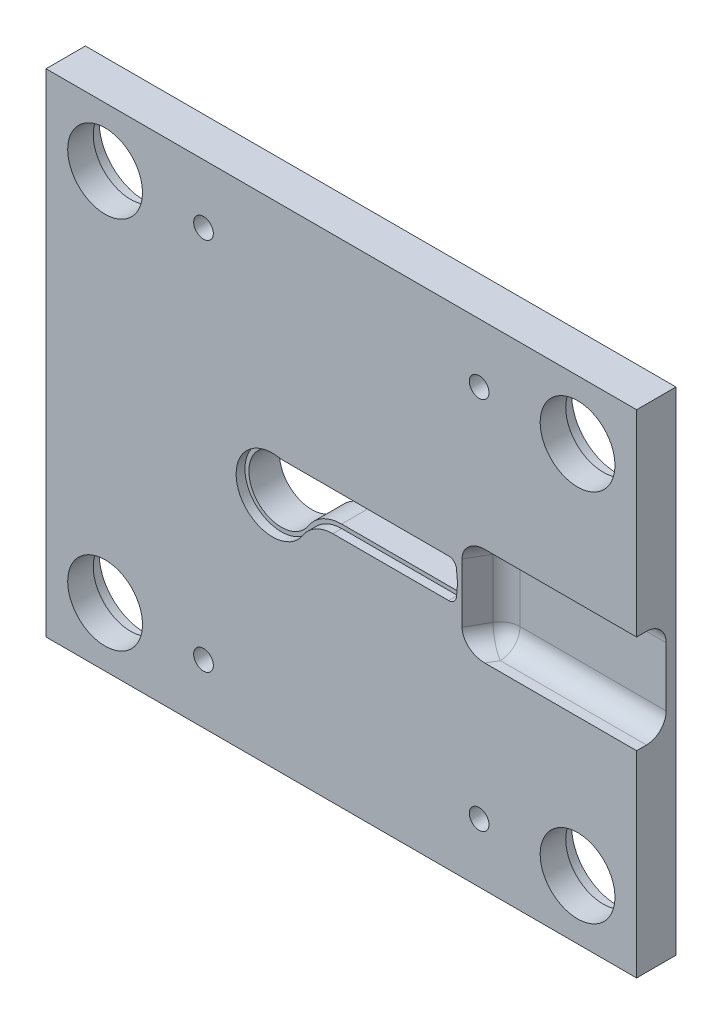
ISO-10303-21;
HEADER;
FILE_DESCRIPTION(('STEP AP214'),'2;1');
FILE_NAME('part.step','',(''),(''),'','','');
FILE_SCHEMA(('AUTOMOTIVE_DESIGN { 1 0 10303 214 1 1 1 1 }'));
ENDSEC;
DATA;
#1=APPLICATION_CONTEXT('core data for automotive mechanical design processes');
#2=APPLICATION_PROTOCOL_DEFINITION('international standard','automotive_design',2000,#1);
#3=PRODUCT_CONTEXT('',#1,'mechanical');
#4=PRODUCT('Part','Part','',(#3));
#5=PRODUCT_RELATED_PRODUCT_CATEGORY('part','',(#4));
#6=PRODUCT_DEFINITION_FORMATION('','',#4);
#7=PRODUCT_DEFINITION_CONTEXT('part definition',#1,'design');
#8=PRODUCT_DEFINITION('design','',#6,#7);
#9=PRODUCT_DEFINITION_SHAPE('','',#8);
#10=(LENGTH_UNIT() NAMED_UNIT(*) SI_UNIT(.MILLI.,.METRE.));
#11=(NAMED_UNIT(*) PLANE_ANGLE_UNIT() SI_UNIT($,.RADIAN.));
#12=(NAMED_UNIT(*) SI_UNIT($,.STERADIAN.) SOLID_ANGLE_UNIT());
#13=UNCERTAINTY_MEASURE_WITH_UNIT(LENGTH_MEASURE(1.E-05),#10,'distance_accuracy_value','');
#14=(GEOMETRIC_REPRESENTATION_CONTEXT(3) GLOBAL_UNCERTAINTY_ASSIGNED_CONTEXT((#13)) GLOBAL_UNIT_ASSIGNED_CONTEXT((#10,
#11,#12)) REPRESENTATION_CONTEXT('',''));
#15=CARTESIAN_POINT('',(0.,0.,0.));
#16=DIRECTION('',(0.,0.,1.));
#17=DIRECTION('',(1.,0.,0.));
#18=AXIS2_PLACEMENT_3D('',#15,#16,#17);
#19=CARTESIAN_POINT('',(121.078190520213,155.965,0.));
#20=DIRECTION('',(0.,0.,1.));
#21=DIRECTION('',(1.,0.,0.));
#22=AXIS2_PLACEMENT_3D('',#19,#20,#21);
#23=CYLINDRICAL_SURFACE('',#22,20.03);
#24=CARTESIAN_POINT('',(121.078190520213,155.965,15.5));
#25=DIRECTION('',(0.,0.,1.));
#26=DIRECTION('',(1.,0.,0.));
#27=AXIS2_PLACEMENT_3D('',#24,#25,#26);
#28=CIRCLE('',#27,20.03);
#29=CARTESIAN_POINT('',(117.740393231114,136.215063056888,15.5));
#30=VERTEX_POINT('',#29);
#31=CARTESIAN_POINT('',(121.078190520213,135.935,15.5));
#32=VERTEX_POINT('',#31);
#33=EDGE_CURVE('E420',#30,#32,#28,.T.);
#34=ORIENTED_EDGE('',*,*,#33,.F.);
#35=DIRECTION('',(0.,0.,1.));
#36=VECTOR('',#35,1.);
#37=CARTESIAN_POINT('',(117.740393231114,136.215063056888,0.));
#38=LINE('',#37,#36);
#39=CARTESIAN_POINT('',(117.740393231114,136.215063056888,0.));
#40=VERTEX_POINT('',#39);
#41=EDGE_CURVE('E449',#40,#30,#38,.T.);
#42=ORIENTED_EDGE('',*,*,#41,.F.);
#43=CARTESIAN_POINT('',(121.078190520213,155.965,0.));
#44=DIRECTION('',(0.,0.,-1.));
#45=DIRECTION('',(-1.,0.,0.));
#46=AXIS2_PLACEMENT_3D('',#43,#44,#45);
#47=CIRCLE('',#46,20.03);
#48=CARTESIAN_POINT('',(121.078190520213,135.935,0.));
#49=VERTEX_POINT('',#48);
#50=EDGE_CURVE('E422',#49,#40,#47,.T.);
#51=ORIENTED_EDGE('',*,*,#50,.F.);
#52=DIRECTION('',(0.,0.,1.));
#53=VECTOR('',#52,1.);
#54=CARTESIAN_POINT('',(121.078190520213,135.935,0.));
#55=LINE('',#54,#53);
#56=EDGE_CURVE('E261',#49,#32,#55,.T.);
#57=ORIENTED_EDGE('',*,*,#56,.T.);
#58=EDGE_LOOP('',(#34,#42,#51,#57));
#59=FACE_BOUND('',#58,.T.);
#60=ADVANCED_FACE('F31',(#59),#23,.T.);
#61=CARTESIAN_POINT('',(121.078190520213,135.935,0.));
#62=DIRECTION('',(0.,1.,0.));
#63=DIRECTION('',(-1.,0.,0.));
#64=AXIS2_PLACEMENT_3D('',#61,#62,#63);
#65=PLANE('',#64);
#66=DIRECTION('',(1.,0.,0.));
#67=VECTOR('',#66,1.);
#68=CARTESIAN_POINT('',(121.078190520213,135.935,15.5));
#69=LINE('',#68,#67);
#70=CARTESIAN_POINT('',(204.489847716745,135.935,15.5));
#71=VERTEX_POINT('',#70);
#72=EDGE_CURVE('E418',#32,#71,#69,.T.);
#73=ORIENTED_EDGE('',*,*,#72,.F.);
#74=ORIENTED_EDGE('',*,*,#56,.F.);
#75=DIRECTION('',(-1.,0.,0.));
#76=VECTOR('',#75,1.);
#77=CARTESIAN_POINT('',(121.078190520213,135.935,0.));
#78=LINE('',#77,#76);
#79=CARTESIAN_POINT('',(204.489847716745,135.935,0.));
#80=VERTEX_POINT('',#79);
#81=EDGE_CURVE('E446',#80,#49,#78,.T.);
#82=ORIENTED_EDGE('',*,*,#81,.F.);
#83=DIRECTION('',(0.,0.,1.));
#84=VECTOR('',#83,1.);
#85=CARTESIAN_POINT('',(204.489847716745,135.935,0.));
#86=LINE('',#85,#84);
#87=EDGE_CURVE('E452',#80,#71,#86,.T.);
#88=ORIENTED_EDGE('',*,*,#87,.T.);
#89=EDGE_LOOP('',(#73,#74,#82,#88));
#90=FACE_BOUND('',#89,.T.);
#91=ADVANCED_FACE('F527',(#90),#65,.F.);
#92=CARTESIAN_POINT('',(204.489847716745,133.905,0.));
#93=DIRECTION('',(0.,0.,1.));
#94=DIRECTION('',(1.,0.,0.));
#95=AXIS2_PLACEMENT_3D('',#92,#93,#94);
#96=CYLINDRICAL_SURFACE('',#95,2.02999999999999);
#97=CARTESIAN_POINT('',(204.489847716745,133.905,15.5));
#98=DIRECTION('',(0.,0.,1.));
#99=DIRECTION('',(1.,0.,0.));
#100=AXIS2_PLACEMENT_3D('',#97,#98,#99);
#101=CIRCLE('',#100,2.02999999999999);
#102=CARTESIAN_POINT('',(206.512122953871,134.081926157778,15.5));
#103=VERTEX_POINT('',#102);
#104=EDGE_CURVE('E416',#71,#103,#101,.F.);
#105=ORIENTED_EDGE('',*,*,#104,.F.);
#106=ORIENTED_EDGE('',*,*,#87,.F.);
#107=CARTESIAN_POINT('',(204.489847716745,133.905,0.));
#108=DIRECTION('',(0.,0.,1.));
#109=DIRECTION('',(-1.,0.,0.));
#110=AXIS2_PLACEMENT_3D('',#107,#108,#109);
#111=CIRCLE('',#110,2.02999999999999);
#112=CARTESIAN_POINT('',(206.512122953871,134.081926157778,0.));
#113=VERTEX_POINT('',#112);
#114=EDGE_CURVE('E443',#113,#80,#111,.T.);
#115=ORIENTED_EDGE('',*,*,#114,.F.);
#116=DIRECTION('',(0.,0.,1.));
#117=VECTOR('',#116,1.);
#118=CARTESIAN_POINT('',(206.512122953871,134.081926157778,0.));
#119=LINE('',#118,#117);
#120=EDGE_CURVE('E455',#113,#103,#119,.T.);
#121=ORIENTED_EDGE('',*,*,#120,.T.);
#122=EDGE_LOOP('',(#105,#106,#115,#121));
#123=FACE_BOUND('',#122,.T.);
#124=ADVANCED_FACE('F533',(#123),#96,.F.);
#125=CARTESIAN_POINT('',(206.512122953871,134.081926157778,0.));
#126=DIRECTION('',(0.996194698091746,0.0871557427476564,0.));
#127=DIRECTION('',(-0.0871557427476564,0.996194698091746,0.));
#128=AXIS2_PLACEMENT_3D('',#125,#126,#127);
#129=PLANE('',#128);
#130=DIRECTION('',(0.0871557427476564,-0.996194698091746,0.));
#131=VECTOR('',#130,1.);
#132=CARTESIAN_POINT('',(206.512122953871,134.081926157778,15.5));
#133=LINE('',#132,#131);
#134=CARTESIAN_POINT('',(207.033723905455,128.12,15.5));
#135=VERTEX_POINT('',#134);
#136=EDGE_CURVE('E414',#103,#135,#133,.T.);
#137=ORIENTED_EDGE('',*,*,#136,.F.);
#138=ORIENTED_EDGE('',*,*,#120,.F.);
#139=DIRECTION('',(-0.0871557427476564,0.996194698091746,0.));
#140=VECTOR('',#139,1.);
#141=CARTESIAN_POINT('',(206.512122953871,134.081926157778,0.));
#142=LINE('',#141,#140);
#143=CARTESIAN_POINT('',(207.033723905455,128.12,0.));
#144=VERTEX_POINT('',#143);
#145=EDGE_CURVE('E440',#144,#113,#142,.T.);
#146=ORIENTED_EDGE('',*,*,#145,.F.);
#147=DIRECTION('',(0.,0.,1.));
#148=VECTOR('',#147,1.);
#149=CARTESIAN_POINT('',(207.033723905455,128.12,0.));
#150=LINE('',#149,#148);
#151=EDGE_CURVE('E458',#144,#135,#150,.T.);
#152=ORIENTED_EDGE('',*,*,#151,.T.);
#153=EDGE_LOOP('',(#137,#138,#146,#152));
#154=FACE_BOUND('',#153,.T.);
#155=ADVANCED_FACE('F754',(#154),#129,.F.);
#156=CARTESIAN_POINT('',(206.512122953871,122.158073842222,0.));
#157=DIRECTION('',(0.996194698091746,-0.0871557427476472,0.));
#158=DIRECTION('',(0.0871557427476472,0.996194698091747,0.));
#159=AXIS2_PLACEMENT_3D('',#156,#157,#158);
#160=PLANE('',#159);
#161=DIRECTION('',(-0.0871557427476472,-0.996194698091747,0.));
#162=VECTOR('',#161,1.);
#163=CARTESIAN_POINT('',(206.512122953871,122.158073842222,15.5));
#164=LINE('',#163,#162);
#165=CARTESIAN_POINT('',(206.512122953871,122.158073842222,15.5));
#166=VERTEX_POINT('',#165);
#167=EDGE_CURVE('E412',#135,#166,#164,.T.);
#168=ORIENTED_EDGE('',*,*,#167,.F.);
#169=ORIENTED_EDGE('',*,*,#151,.F.);
#170=DIRECTION('',(0.0871557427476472,0.996194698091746,0.));
#171=VECTOR('',#170,1.);
#172=CARTESIAN_POINT('',(206.512122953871,122.158073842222,0.));
#173=LINE('',#172,#171);
#174=CARTESIAN_POINT('',(206.512122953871,122.158073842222,0.));
#175=VERTEX_POINT('',#174);
#176=EDGE_CURVE('E437',#175,#144,#173,.T.);
#177=ORIENTED_EDGE('',*,*,#176,.F.);
#178=DIRECTION('',(0.,0.,1.));
#179=VECTOR('',#178,1.);
#180=CARTESIAN_POINT('',(206.512122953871,122.158073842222,0.));
#181=LINE('',#180,#179);
#182=EDGE_CURVE('E461',#175,#166,#181,.T.);
#183=ORIENTED_EDGE('',*,*,#182,.T.);
#184=EDGE_LOOP('',(#168,#169,#177,#183));
#185=FACE_BOUND('',#184,.T.);
#186=ADVANCED_FACE('F744',(#185),#160,.F.);
#187=CARTESIAN_POINT('',(204.489847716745,122.335,0.));
#188=DIRECTION('',(0.,0.,1.));
#189=DIRECTION('',(1.,0.,0.));
#190=AXIS2_PLACEMENT_3D('',#187,#188,#189);
#191=CYLINDRICAL_SURFACE('',#190,2.03000000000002);
#192=CARTESIAN_POINT('',(204.489847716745,122.335,15.5));
#193=DIRECTION('',(0.,0.,1.));
#194=DIRECTION('',(1.,0.,0.));
#195=AXIS2_PLACEMENT_3D('',#192,#193,#194);
#196=CIRCLE('',#195,2.03000000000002);
#197=CARTESIAN_POINT('',(204.489847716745,120.305,15.5));
#198=VERTEX_POINT('',#197);
#199=EDGE_CURVE('E410',#166,#198,#196,.F.);
#200=ORIENTED_EDGE('',*,*,#199,.F.);
#201=ORIENTED_EDGE('',*,*,#182,.F.);
#202=CARTESIAN_POINT('',(204.489847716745,122.335,0.));
#203=DIRECTION('',(0.,0.,1.));
#204=DIRECTION('',(1.,0.,0.));
#205=AXIS2_PLACEMENT_3D('',#202,#203,#204);
#206=CIRCLE('',#205,2.03000000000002);
#207=CARTESIAN_POINT('',(204.489847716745,120.305,0.));
#208=VERTEX_POINT('',#207);
#209=EDGE_CURVE('E434',#208,#175,#206,.T.);
#210=ORIENTED_EDGE('',*,*,#209,.F.);
#211=DIRECTION('',(0.,0.,1.));
#212=VECTOR('',#211,1.);
#213=CARTESIAN_POINT('',(204.489847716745,120.305,0.));
#214=LINE('',#213,#212);
#215=EDGE_CURVE('E464',#208,#198,#214,.T.);
#216=ORIENTED_EDGE('',*,*,#215,.T.);
#217=EDGE_LOOP('',(#200,#201,#210,#216));
#218=FACE_BOUND('',#217,.T.);
#219=ADVANCED_FACE('F734',(#218),#191,.F.);
#220=CARTESIAN_POINT('',(145.681427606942,120.305,0.));
#221=DIRECTION('',(0.,-1.,0.));
#222=DIRECTION('',(1.,0.,0.));
#223=AXIS2_PLACEMENT_3D('',#220,#221,#222);
#224=PLANE('',#223);
#225=DIRECTION('',(-1.,0.,0.));
#226=VECTOR('',#225,1.);
#227=CARTESIAN_POINT('',(145.681427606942,120.305,15.5));
#228=LINE('',#227,#226);
#229=CARTESIAN_POINT('',(145.681427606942,120.305,15.5));
#230=VERTEX_POINT('',#229);
#231=EDGE_CURVE('E408',#198,#230,#228,.T.);
#232=ORIENTED_EDGE('',*,*,#231,.F.);
#233=ORIENTED_EDGE('',*,*,#215,.F.);
#234=DIRECTION('',(1.,0.,0.));
#235=VECTOR('',#234,1.);
#236=CARTESIAN_POINT('',(145.681427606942,120.305,0.));
#237=LINE('',#236,#235);
#238=CARTESIAN_POINT('',(145.681427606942,120.305,0.));
#239=VERTEX_POINT('',#238);
#240=EDGE_CURVE('E431',#239,#208,#237,.T.);
#241=ORIENTED_EDGE('',*,*,#240,.F.);
#242=DIRECTION('',(0.,0.,1.));
#243=VECTOR('',#242,1.);
#244=CARTESIAN_POINT('',(145.681427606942,120.305,0.));
#245=LINE('',#244,#243);
#246=EDGE_CURVE('E467',#239,#230,#245,.T.);
#247=ORIENTED_EDGE('',*,*,#246,.T.);
#248=EDGE_LOOP('',(#232,#233,#241,#247));
#249=FACE_BOUND('',#248,.T.);
#250=ADVANCED_FACE('F725',(#249),#224,.F.);
#251=CARTESIAN_POINT('',(145.681427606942,100.275,0.));
#252=DIRECTION('',(0.,0.,1.));
#253=DIRECTION('',(1.,0.,0.));
#254=AXIS2_PLACEMENT_3D('',#251,#252,#253);
#255=CYLINDRICAL_SURFACE('',#254,20.03);
#256=CARTESIAN_POINT('',(145.681427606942,100.275,15.5));
#257=DIRECTION('',(0.,0.,1.));
#258=DIRECTION('',(1.,0.,0.));
#259=AXIS2_PLACEMENT_3D('',#256,#257,#258);
#260=CIRCLE('',#259,20.03);
#261=CARTESIAN_POINT('',(128.832928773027,111.106850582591,15.5));
#262=VERTEX_POINT('',#261);
#263=EDGE_CURVE('E390',#230,#262,#260,.T.);
#264=ORIENTED_EDGE('',*,*,#263,.F.);
#265=ORIENTED_EDGE('',*,*,#246,.F.);
#266=CARTESIAN_POINT('',(145.681427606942,100.275,0.));
#267=DIRECTION('',(0.,0.,-1.));
#268=DIRECTION('',(1.,0.,0.));
#269=AXIS2_PLACEMENT_3D('',#266,#267,#268);
#270=CIRCLE('',#269,20.03);
#271=CARTESIAN_POINT('',(128.832928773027,111.106850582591,0.));
#272=VERTEX_POINT('',#271);
#273=EDGE_CURVE('E428',#272,#239,#270,.T.);
#274=ORIENTED_EDGE('',*,*,#273,.F.);
#275=DIRECTION('',(0.,0.,1.));
#276=VECTOR('',#275,1.);
#277=CARTESIAN_POINT('',(128.832928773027,111.106850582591,0.));
#278=LINE('',#277,#276);
#279=EDGE_CURVE('E470',#272,#262,#278,.T.);
#280=ORIENTED_EDGE('',*,*,#279,.T.);
#281=EDGE_LOOP('',(#264,#265,#274,#280));
#282=FACE_BOUND('',#281,.T.);
#283=ADVANCED_FACE('F715',(#282),#255,.T.);
#284=CARTESIAN_POINT('',(115.,120.,0.));
#285=DIRECTION('',(0.,0.,1.));
#286=DIRECTION('',(1.,0.,0.));
#287=AXIS2_PLACEMENT_3D('',#284,#285,#286);
#288=CYLINDRICAL_SURFACE('',#287,16.445);
#289=CARTESIAN_POINT('',(115.,120.,15.5));
#290=DIRECTION('',(0.,0.,1.));
#291=DIRECTION('',(1.,0.,0.));
#292=AXIS2_PLACEMENT_3D('',#289,#290,#291);
#293=CIRCLE('',#292,16.445);
#294=EDGE_CURVE('E278',#262,#30,#293,.F.);
#295=ORIENTED_EDGE('',*,*,#294,.F.);
#296=ORIENTED_EDGE('',*,*,#279,.F.);
#297=CARTESIAN_POINT('',(115.,120.,0.));
#298=DIRECTION('',(0.,0.,1.));
#299=DIRECTION('',(1.,0.,0.));
#300=AXIS2_PLACEMENT_3D('',#297,#298,#299);
#301=CIRCLE('',#300,16.445);
#302=EDGE_CURVE('E425',#40,#272,#301,.T.);
#303=ORIENTED_EDGE('',*,*,#302,.F.);
#304=ORIENTED_EDGE('',*,*,#41,.T.);
#305=EDGE_LOOP('',(#295,#296,#303,#304));
#306=FACE_BOUND('',#305,.T.);
#307=ADVANCED_FACE('F539',(#306),#288,.F.);
#308=CARTESIAN_POINT('',(0.,0.,20.));
#309=DIRECTION('',(1.,0.,0.));
#310=DIRECTION('',(0.,0.,-1.));
#311=AXIS2_PLACEMENT_3D('',#308,#309,#310);
#312=PLANE('',#311);
#313=DIRECTION('',(0.,-1.,0.));
#314=VECTOR('',#313,1.);
#315=CARTESIAN_POINT('',(0.,0.,0.));
#316=LINE('',#315,#314);
#317=CARTESIAN_POINT('',(0.,250.,0.));
#318=VERTEX_POINT('',#317);
#319=CARTESIAN_POINT('',(0.,0.,0.));
#320=VERTEX_POINT('',#319);
#321=EDGE_CURVE('E257',#318,#320,#316,.T.);
#322=ORIENTED_EDGE('',*,*,#321,.T.);
#323=DIRECTION('',(0.,0.,-1.));
#324=VECTOR('',#323,1.);
#325=CARTESIAN_POINT('',(0.,0.,20.));
#326=LINE('',#325,#324);
#327=CARTESIAN_POINT('',(0.,0.,20.));
#328=VERTEX_POINT('',#327);
#329=EDGE_CURVE('E275',#328,#320,#326,.T.);
#330=ORIENTED_EDGE('',*,*,#329,.F.);
#331=DIRECTION('',(0.,-1.,0.));
#332=VECTOR('',#331,1.);
#333=CARTESIAN_POINT('',(0.,0.,20.));
#334=LINE('',#333,#332);
#335=CARTESIAN_POINT('',(0.,250.,20.));
#336=VERTEX_POINT('',#335);
#337=EDGE_CURVE('E267',#336,#328,#334,.T.);
#338=ORIENTED_EDGE('',*,*,#337,.F.);
#339=DIRECTION('',(0.,0.,-1.));
#340=VECTOR('',#339,1.);
#341=CARTESIAN_POINT('',(0.,250.,20.));
#342=LINE('',#341,#340);
#343=EDGE_CURVE('E252',#336,#318,#342,.T.);
#344=ORIENTED_EDGE('',*,*,#343,.T.);
#345=EDGE_LOOP('',(#322,#330,#338,#344));
#346=FACE_BOUND('',#345,.T.);
#347=ADVANCED_FACE('F479',(#346),#312,.F.);
#348=CARTESIAN_POINT('',(0.,0.,20.));
#349=DIRECTION('',(0.,1.,0.));
#350=DIRECTION('',(0.,0.,1.));
#351=AXIS2_PLACEMENT_3D('',#348,#349,#350);
#352=PLANE('',#351);
#353=DIRECTION('',(1.,0.,0.));
#354=VECTOR('',#353,1.);
#355=CARTESIAN_POINT('',(0.,0.,0.));
#356=LINE('',#355,#354);
#357=CARTESIAN_POINT('',(300.,0.,0.));
#358=VERTEX_POINT('',#357);
#359=EDGE_CURVE('E260',#320,#358,#356,.T.);
#360=ORIENTED_EDGE('',*,*,#359,.T.);
#361=DIRECTION('',(0.,0.,-1.));
#362=VECTOR('',#361,1.);
#363=CARTESIAN_POINT('',(300.,0.,20.));
#364=LINE('',#363,#362);
#365=CARTESIAN_POINT('',(300.,0.,20.));
#366=VERTEX_POINT('',#365);
#367=EDGE_CURVE('E273',#366,#358,#364,.T.);
#368=ORIENTED_EDGE('',*,*,#367,.F.);
#369=DIRECTION('',(1.,0.,0.));
#370=VECTOR('',#369,1.);
#371=CARTESIAN_POINT('',(0.,0.,20.));
#372=LINE('',#371,#370);
#373=EDGE_CURVE('E247',#328,#366,#372,.T.);
#374=ORIENTED_EDGE('',*,*,#373,.F.);
#375=ORIENTED_EDGE('',*,*,#329,.T.);
#376=EDGE_LOOP('',(#360,#368,#374,#375));
#377=FACE_BOUND('',#376,.T.);
#378=ADVANCED_FACE('F482',(#377),#352,.F.);
#379=CARTESIAN_POINT('',(300.,0.,20.));
#380=DIRECTION('',(-1.,0.,0.));
#381=DIRECTION('',(0.,0.,1.));
#382=AXIS2_PLACEMENT_3D('',#379,#380,#381);
#383=PLANE('',#382);
#384=DIRECTION('',(0.,1.,0.));
#385=VECTOR('',#384,1.);
#386=CARTESIAN_POINT('',(300.,150.,5.));
#387=LINE('',#386,#385);
#388=CARTESIAN_POINT('',(300.,110.,5.));
#389=VERTEX_POINT('',#388);
#390=CARTESIAN_POINT('',(300.,140.,5.));
#391=VERTEX_POINT('',#390);
#392=EDGE_CURVE('E242',#389,#391,#387,.T.);
#393=ORIENTED_EDGE('',*,*,#392,.F.);
#394=CARTESIAN_POINT('',(300.,110.,15.));
#395=DIRECTION('',(-1.,0.,0.));
#396=DIRECTION('',(0.,0.,1.));
#397=AXIS2_PLACEMENT_3D('',#394,#395,#396);
#398=CIRCLE('',#397,10.);
#399=CARTESIAN_POINT('',(300.,100.,15.));
#400=VERTEX_POINT('',#399);
#401=EDGE_CURVE('E11',#389,#400,#398,.T.);
#402=ORIENTED_EDGE('',*,*,#401,.T.);
#403=DIRECTION('',(0.,0.,1.));
#404=VECTOR('',#403,1.);
#405=CARTESIAN_POINT('',(300.,100.,5.));
#406=LINE('',#405,#404);
#407=CARTESIAN_POINT('',(300.,100.,20.));
#408=VERTEX_POINT('',#407);
#409=EDGE_CURVE('E227',#400,#408,#406,.T.);
#410=ORIENTED_EDGE('',*,*,#409,.T.);
#411=DIRECTION('',(0.,1.,0.));
#412=VECTOR('',#411,1.);
#413=CARTESIAN_POINT('',(300.,0.,20.));
#414=LINE('',#413,#412);
#415=EDGE_CURVE('E232',#366,#408,#414,.T.);
#416=ORIENTED_EDGE('',*,*,#415,.F.);
#417=ORIENTED_EDGE('',*,*,#367,.T.);
#418=DIRECTION('',(0.,1.,0.));
#419=VECTOR('',#418,1.);
#420=CARTESIAN_POINT('',(300.,0.,0.));
#421=LINE('',#420,#419);
#422=CARTESIAN_POINT('',(300.,250.,0.));
#423=VERTEX_POINT('',#422);
#424=EDGE_CURVE('E263',#358,#423,#421,.T.);
#425=ORIENTED_EDGE('',*,*,#424,.T.);
#426=DIRECTION('',(0.,0.,-1.));
#427=VECTOR('',#426,1.);
#428=CARTESIAN_POINT('',(300.,250.,20.));
#429=LINE('',#428,#427);
#430=CARTESIAN_POINT('',(300.,250.,20.));
#431=VERTEX_POINT('',#430);
#432=EDGE_CURVE('E270',#431,#423,#429,.T.);
#433=ORIENTED_EDGE('',*,*,#432,.F.);
#434=CARTESIAN_POINT('',(300.,150.,20.));
#435=VERTEX_POINT('',#434);
#436=EDGE_CURVE('E250',#435,#431,#414,.T.);
#437=ORIENTED_EDGE('',*,*,#436,.F.);
#438=DIRECTION('',(0.,0.,1.));
#439=VECTOR('',#438,1.);
#440=CARTESIAN_POINT('',(300.,150.,5.));
#441=LINE('',#440,#439);
#442=CARTESIAN_POINT('',(300.,150.,15.));
#443=VERTEX_POINT('',#442);
#444=EDGE_CURVE('E234',#443,#435,#441,.T.);
#445=ORIENTED_EDGE('',*,*,#444,.F.);
#446=CARTESIAN_POINT('',(300.,140.,15.));
#447=DIRECTION('',(-1.,0.,0.));
#448=DIRECTION('',(0.,0.,1.));
#449=AXIS2_PLACEMENT_3D('',#446,#447,#448);
#450=CIRCLE('',#449,10.);
#451=EDGE_CURVE('E304',#443,#391,#450,.T.);
#452=ORIENTED_EDGE('',*,*,#451,.T.);
#453=EDGE_LOOP('',(#393,#402,#410,#416,#417,#425,#433,#437,#445,#452));
#454=FACE_BOUND('',#453,.T.);
#455=ADVANCED_FACE('F229',(#454),#383,.F.);
#456=CARTESIAN_POINT('',(0.,250.,20.));
#457=DIRECTION('',(0.,-1.,0.));
#458=DIRECTION('',(0.,0.,-1.));
#459=AXIS2_PLACEMENT_3D('',#456,#457,#458);
#460=PLANE('',#459);
#461=DIRECTION('',(-1.,0.,0.));
#462=VECTOR('',#461,1.);
#463=CARTESIAN_POINT('',(0.,250.,0.));
#464=LINE('',#463,#462);
#465=EDGE_CURVE('E265',#423,#318,#464,.T.);
#466=ORIENTED_EDGE('',*,*,#465,.T.);
#467=ORIENTED_EDGE('',*,*,#343,.F.);
#468=DIRECTION('',(-1.,0.,0.));
#469=VECTOR('',#468,1.);
#470=CARTESIAN_POINT('',(0.,250.,20.));
#471=LINE('',#470,#469);
#472=EDGE_CURVE('E249',#431,#336,#471,.T.);
#473=ORIENTED_EDGE('',*,*,#472,.F.);
#474=ORIENTED_EDGE('',*,*,#432,.T.);
#475=EDGE_LOOP('',(#466,#467,#473,#474));
#476=FACE_BOUND('',#475,.T.);
#477=ADVANCED_FACE('F489',(#476),#460,.F.);
#478=CARTESIAN_POINT('',(0.,250.,20.));
#479=DIRECTION('',(0.,0.,-1.));
#480=DIRECTION('',(-1.,0.,0.));
#481=AXIS2_PLACEMENT_3D('',#478,#479,#480);
#482=PLANE('',#481);
#483=CARTESIAN_POINT('',(220.,220.,20.));
#484=DIRECTION('',(0.,0.,-1.));
#485=DIRECTION('',(-1.,0.,0.));
#486=AXIS2_PLACEMENT_3D('',#483,#484,#485);
#487=CIRCLE('',#486,4.99999999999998);
#488=CARTESIAN_POINT('',(215.,220.,20.));
#489=VERTEX_POINT('',#488);
#490=EDGE_CURVE('E976',#489,#489,#487,.T.);
#491=ORIENTED_EDGE('',*,*,#490,.T.);
#492=EDGE_LOOP('',(#491));
#493=FACE_BOUND('',#492,.T.);
#494=CARTESIAN_POINT('',(80.,220.,20.));
#495=DIRECTION('',(0.,0.,-1.));
#496=DIRECTION('',(-1.,0.,0.));
#497=AXIS2_PLACEMENT_3D('',#494,#495,#496);
#498=CIRCLE('',#497,4.99999999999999);
#499=CARTESIAN_POINT('',(75.,220.,20.));
#500=VERTEX_POINT('',#499);
#501=EDGE_CURVE('E970',#500,#500,#498,.T.);
#502=ORIENTED_EDGE('',*,*,#501,.T.);
#503=EDGE_LOOP('',(#502));
#504=FACE_BOUND('',#503,.T.);
#505=CARTESIAN_POINT('',(79.9999999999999,30.,20.));
#506=DIRECTION('',(0.,0.,-1.));
#507=DIRECTION('',(-1.,0.,0.));
#508=AXIS2_PLACEMENT_3D('',#505,#506,#507);
#509=CIRCLE('',#508,4.99999999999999);
#510=CARTESIAN_POINT('',(75.,30.,20.));
#511=VERTEX_POINT('',#510);
#512=EDGE_CURVE('E964',#511,#511,#509,.T.);
#513=ORIENTED_EDGE('',*,*,#512,.T.);
#514=EDGE_LOOP('',(#513));
#515=FACE_BOUND('',#514,.T.);
#516=CARTESIAN_POINT('',(220.,30.,20.));
#517=DIRECTION('',(0.,0.,-1.));
#518=DIRECTION('',(-1.,0.,0.));
#519=AXIS2_PLACEMENT_3D('',#516,#517,#518);
#520=CIRCLE('',#519,4.99999999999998);
#521=CARTESIAN_POINT('',(215.,30.,20.));
#522=VERTEX_POINT('',#521);
#523=EDGE_CURVE('E958',#522,#522,#520,.T.);
#524=ORIENTED_EDGE('',*,*,#523,.T.);
#525=EDGE_LOOP('',(#524));
#526=FACE_BOUND('',#525,.T.);
#527=CARTESIAN_POINT('',(270.,220.,20.));
#528=DIRECTION('',(0.,0.,-1.));
#529=DIRECTION('',(-1.,0.,0.));
#530=AXIS2_PLACEMENT_3D('',#527,#528,#529);
#531=CIRCLE('',#530,19.);
#532=CARTESIAN_POINT('',(251.,220.,20.));
#533=VERTEX_POINT('',#532);
#534=EDGE_CURVE('E947',#533,#533,#531,.T.);
#535=ORIENTED_EDGE('',*,*,#534,.T.);
#536=EDGE_LOOP('',(#535));
#537=FACE_BOUND('',#536,.T.);
#538=CARTESIAN_POINT('',(270.,30.,20.));
#539=DIRECTION('',(0.,0.,-1.));
#540=DIRECTION('',(-1.,0.,0.));
#541=AXIS2_PLACEMENT_3D('',#538,#539,#540);
#542=CIRCLE('',#541,19.);
#543=CARTESIAN_POINT('',(251.,30.,20.));
#544=VERTEX_POINT('',#543);
#545=EDGE_CURVE('E941',#544,#544,#542,.T.);
#546=ORIENTED_EDGE('',*,*,#545,.T.);
#547=EDGE_LOOP('',(#546));
#548=FACE_BOUND('',#547,.T.);
#549=CARTESIAN_POINT('',(30.,30.,20.));
#550=DIRECTION('',(0.,0.,-1.));
#551=DIRECTION('',(-1.,0.,0.));
#552=AXIS2_PLACEMENT_3D('',#549,#550,#551);
#553=CIRCLE('',#552,19.);
#554=CARTESIAN_POINT('',(11.,30.,20.));
#555=VERTEX_POINT('',#554);
#556=EDGE_CURVE('E935',#555,#555,#553,.T.);
#557=ORIENTED_EDGE('',*,*,#556,.T.);
#558=EDGE_LOOP('',(#557));
#559=FACE_BOUND('',#558,.T.);
#560=CARTESIAN_POINT('',(30.,220.,20.));
#561=DIRECTION('',(0.,0.,-1.));
#562=DIRECTION('',(-1.,0.,0.));
#563=AXIS2_PLACEMENT_3D('',#560,#561,#562);
#564=CIRCLE('',#563,19.);
#565=CARTESIAN_POINT('',(11.,220.,20.));
#566=VERTEX_POINT('',#565);
#567=EDGE_CURVE('E929',#566,#566,#564,.T.);
#568=ORIENTED_EDGE('',*,*,#567,.T.);
#569=EDGE_LOOP('',(#568));
#570=FACE_BOUND('',#569,.T.);
#571=DIRECTION('',(0.087155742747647,0.996194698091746,0.));
#572=VECTOR('',#571,1.);
#573=CARTESIAN_POINT('',(208.504512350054,121.983762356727,20.));
#574=LINE('',#573,#572);
#575=CARTESIAN_POINT('',(208.504512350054,121.983762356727,20.));
#576=VERTEX_POINT('',#575);
#577=CARTESIAN_POINT('',(209.041363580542,128.12,20.));
#578=VERTEX_POINT('',#577);
#579=EDGE_CURVE('E365',#576,#578,#574,.T.);
#580=ORIENTED_EDGE('',*,*,#579,.F.);
#581=CARTESIAN_POINT('',(204.489847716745,122.335,20.));
#582=DIRECTION('',(0.,0.,1.));
#583=DIRECTION('',(1.,0.,0.));
#584=AXIS2_PLACEMENT_3D('',#581,#582,#583);
#585=CIRCLE('',#584,4.03000000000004);
#586=CARTESIAN_POINT('',(204.489847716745,118.305,20.));
#587=VERTEX_POINT('',#586);
#588=EDGE_CURVE('E233',#587,#576,#585,.T.);
#589=ORIENTED_EDGE('',*,*,#588,.F.);
#590=DIRECTION('',(1.,0.,0.));
#591=VECTOR('',#590,1.);
#592=CARTESIAN_POINT('',(145.681427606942,118.305,20.));
#593=LINE('',#592,#591);
#594=CARTESIAN_POINT('',(145.681427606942,118.305,20.));
#595=VERTEX_POINT('',#594);
#596=EDGE_CURVE('E339',#595,#587,#593,.T.);
#597=ORIENTED_EDGE('',*,*,#596,.F.);
#598=CARTESIAN_POINT('',(145.681427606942,100.275,20.));
#599=DIRECTION('',(0.,0.,-1.));
#600=DIRECTION('',(1.,0.,0.));
#601=AXIS2_PLACEMENT_3D('',#598,#599,#600);
#602=CIRCLE('',#601,18.03);
#603=CARTESIAN_POINT('',(130.515255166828,110.025287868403,20.));
#604=VERTEX_POINT('',#603);
#605=EDGE_CURVE('E383',#604,#595,#602,.T.);
#606=ORIENTED_EDGE('',*,*,#605,.F.);
#607=CARTESIAN_POINT('',(115.,120.,20.));
#608=DIRECTION('',(0.,0.,1.));
#609=DIRECTION('',(1.,0.,0.));
#610=AXIS2_PLACEMENT_3D('',#607,#608,#609);
#611=CIRCLE('',#610,18.445);
#612=CARTESIAN_POINT('',(118.07367304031,138.187098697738,20.));
#613=VERTEX_POINT('',#612);
#614=EDGE_CURVE('E380',#613,#604,#611,.T.);
#615=ORIENTED_EDGE('',*,*,#614,.F.);
#616=CARTESIAN_POINT('',(121.078190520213,155.965,20.));
#617=DIRECTION('',(0.,0.,-1.));
#618=DIRECTION('',(1.,0.,0.));
#619=AXIS2_PLACEMENT_3D('',#616,#617,#618);
#620=CIRCLE('',#619,18.03);
#621=CARTESIAN_POINT('',(121.078190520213,137.935,20.));
#622=VERTEX_POINT('',#621);
#623=EDGE_CURVE('E377',#622,#613,#620,.T.);
#624=ORIENTED_EDGE('',*,*,#623,.F.);
#625=DIRECTION('',(-1.,0.,0.));
#626=VECTOR('',#625,1.);
#627=CARTESIAN_POINT('',(204.489847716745,137.935,20.));
#628=LINE('',#627,#626);
#629=CARTESIAN_POINT('',(204.489847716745,137.935,20.));
#630=VERTEX_POINT('',#629);
#631=EDGE_CURVE('E374',#630,#622,#628,.T.);
#632=ORIENTED_EDGE('',*,*,#631,.F.);
#633=CARTESIAN_POINT('',(204.489847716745,133.905,20.));
#634=DIRECTION('',(0.,0.,1.));
#635=DIRECTION('',(1.,0.,0.));
#636=AXIS2_PLACEMENT_3D('',#633,#634,#635);
#637=CIRCLE('',#636,4.02999999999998);
#638=CARTESIAN_POINT('',(208.504512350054,134.256237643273,20.));
#639=VERTEX_POINT('',#638);
#640=EDGE_CURVE('E371',#639,#630,#637,.T.);
#641=ORIENTED_EDGE('',*,*,#640,.F.);
#642=DIRECTION('',(-0.0871557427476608,0.996194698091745,0.));
#643=VECTOR('',#642,1.);
#644=CARTESIAN_POINT('',(209.041363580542,128.12,20.));
#645=LINE('',#644,#643);
#646=EDGE_CURVE('E368',#578,#639,#645,.T.);
#647=ORIENTED_EDGE('',*,*,#646,.F.);
#648=EDGE_LOOP('',(#580,#589,#597,#606,#615,#624,#632,#641,#647));
#649=FACE_BOUND('',#648,.T.);
#650=ORIENTED_EDGE('',*,*,#415,.T.);
#651=DIRECTION('',(1.,0.,0.));
#652=VECTOR('',#651,1.);
#653=CARTESIAN_POINT('',(300.,100.,20.));
#654=LINE('',#653,#652);
#655=CARTESIAN_POINT('',(222.886751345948,100.,20.));
#656=VERTEX_POINT('',#655);
#657=EDGE_CURVE('E237',#656,#408,#654,.T.);
#658=ORIENTED_EDGE('',*,*,#657,.F.);
#659=CARTESIAN_POINT('',(222.886751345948,110.,20.));
#660=DIRECTION('',(0.,0.,-1.));
#661=DIRECTION('',(-1.,0.,0.));
#662=AXIS2_PLACEMENT_3D('',#659,#660,#661);
#663=ELLIPSE('',#662,11.5470053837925,10.);
#664=CARTESIAN_POINT('',(211.339745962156,110.,20.));
#665=VERTEX_POINT('',#664);
#666=EDGE_CURVE('E40',#656,#665,#663,.T.);
#667=ORIENTED_EDGE('',*,*,#666,.T.);
#668=DIRECTION('',(0.,1.,0.));
#669=VECTOR('',#668,1.);
#670=CARTESIAN_POINT('',(211.339745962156,150.,20.));
#671=LINE('',#670,#669);
#672=CARTESIAN_POINT('',(211.339745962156,140.,20.));
#673=VERTEX_POINT('',#672);
#674=EDGE_CURVE('E243',#673,#665,#671,.F.);
#675=ORIENTED_EDGE('',*,*,#674,.F.);
#676=CARTESIAN_POINT('',(222.886751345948,140.,20.));
#677=DIRECTION('',(0.,0.,-1.));
#678=DIRECTION('',(-1.,0.,0.));
#679=AXIS2_PLACEMENT_3D('',#676,#677,#678);
#680=ELLIPSE('',#679,11.5470053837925,10.);
#681=CARTESIAN_POINT('',(222.886751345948,150.,20.));
#682=VERTEX_POINT('',#681);
#683=EDGE_CURVE('E302',#673,#682,#680,.T.);
#684=ORIENTED_EDGE('',*,*,#683,.T.);
#685=DIRECTION('',(-1.,0.,0.));
#686=VECTOR('',#685,1.);
#687=CARTESIAN_POINT('',(300.,150.,20.));
#688=LINE('',#687,#686);
#689=EDGE_CURVE('E283',#435,#682,#688,.T.);
#690=ORIENTED_EDGE('',*,*,#689,.F.);
#691=ORIENTED_EDGE('',*,*,#436,.T.);
#692=ORIENTED_EDGE('',*,*,#472,.T.);
#693=ORIENTED_EDGE('',*,*,#337,.T.);
#694=ORIENTED_EDGE('',*,*,#373,.T.);
#695=EDGE_LOOP('',(#650,#658,#667,#675,#684,#690,#691,#692,#693,#694));
#696=FACE_BOUND('',#695,.T.);
#697=ADVANCED_FACE('F245',(#493,#504,#515,#526,#537,#548,#559,#570,#649,#696),#482,.F.);
#698=CARTESIAN_POINT('',(0.,250.,0.));
#699=DIRECTION('',(0.,0.,-1.));
#700=DIRECTION('',(-1.,0.,0.));
#701=AXIS2_PLACEMENT_3D('',#698,#699,#700);
#702=PLANE('',#701);
#703=CARTESIAN_POINT('',(220.,220.,0.));
#704=DIRECTION('',(0.,0.,-1.));
#705=DIRECTION('',(-1.,0.,0.));
#706=AXIS2_PLACEMENT_3D('',#703,#704,#705);
#707=CIRCLE('',#706,4.99999999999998);
#708=CARTESIAN_POINT('',(215.,220.,0.));
#709=VERTEX_POINT('',#708);
#710=EDGE_CURVE('E973',#709,#709,#707,.T.);
#711=ORIENTED_EDGE('',*,*,#710,.F.);
#712=EDGE_LOOP('',(#711));
#713=FACE_BOUND('',#712,.T.);
#714=CARTESIAN_POINT('',(80.,220.,0.));
#715=DIRECTION('',(0.,0.,-1.));
#716=DIRECTION('',(-1.,0.,0.));
#717=AXIS2_PLACEMENT_3D('',#714,#715,#716);
#718=CIRCLE('',#717,4.99999999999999);
#719=CARTESIAN_POINT('',(75.,220.,0.));
#720=VERTEX_POINT('',#719);
#721=EDGE_CURVE('E967',#720,#720,#718,.T.);
#722=ORIENTED_EDGE('',*,*,#721,.F.);
#723=EDGE_LOOP('',(#722));
#724=FACE_BOUND('',#723,.T.);
#725=CARTESIAN_POINT('',(79.9999999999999,30.,0.));
#726=DIRECTION('',(0.,0.,-1.));
#727=DIRECTION('',(-1.,0.,0.));
#728=AXIS2_PLACEMENT_3D('',#725,#726,#727);
#729=CIRCLE('',#728,4.99999999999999);
#730=CARTESIAN_POINT('',(75.,30.,0.));
#731=VERTEX_POINT('',#730);
#732=EDGE_CURVE('E961',#731,#731,#729,.T.);
#733=ORIENTED_EDGE('',*,*,#732,.F.);
#734=EDGE_LOOP('',(#733));
#735=FACE_BOUND('',#734,.T.);
#736=CARTESIAN_POINT('',(220.,30.,0.));
#737=DIRECTION('',(0.,0.,-1.));
#738=DIRECTION('',(-1.,0.,0.));
#739=AXIS2_PLACEMENT_3D('',#736,#737,#738);
#740=CIRCLE('',#739,4.99999999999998);
#741=CARTESIAN_POINT('',(215.,30.,0.));
#742=VERTEX_POINT('',#741);
#743=EDGE_CURVE('E953',#742,#742,#740,.T.);
#744=ORIENTED_EDGE('',*,*,#743,.F.);
#745=EDGE_LOOP('',(#744));
#746=FACE_BOUND('',#745,.T.);
#747=CARTESIAN_POINT('',(270.,220.,0.));
#748=DIRECTION('',(0.,0.,-1.));
#749=DIRECTION('',(-1.,0.,0.));
#750=AXIS2_PLACEMENT_3D('',#747,#748,#749);
#751=CIRCLE('',#750,23.);
#752=CARTESIAN_POINT('',(247.,220.,0.));
#753=VERTEX_POINT('',#752);
#754=EDGE_CURVE('E926',#753,#753,#751,.T.);
#755=ORIENTED_EDGE('',*,*,#754,.F.);
#756=EDGE_LOOP('',(#755));
#757=FACE_BOUND('',#756,.T.);
#758=CARTESIAN_POINT('',(270.,30.,0.));
#759=DIRECTION('',(0.,0.,-1.));
#760=DIRECTION('',(-1.,0.,0.));
#761=AXIS2_PLACEMENT_3D('',#758,#759,#760);
#762=CIRCLE('',#761,23.);
#763=CARTESIAN_POINT('',(247.,30.,0.));
#764=VERTEX_POINT('',#763);
#765=EDGE_CURVE('E920',#764,#764,#762,.T.);
#766=ORIENTED_EDGE('',*,*,#765,.F.);
#767=EDGE_LOOP('',(#766));
#768=FACE_BOUND('',#767,.T.);
#769=CARTESIAN_POINT('',(30.,30.,0.));
#770=DIRECTION('',(0.,0.,-1.));
#771=DIRECTION('',(-1.,0.,0.));
#772=AXIS2_PLACEMENT_3D('',#769,#770,#771);
#773=CIRCLE('',#772,23.);
#774=CARTESIAN_POINT('',(7.,30.,0.));
#775=VERTEX_POINT('',#774);
#776=EDGE_CURVE('E914',#775,#775,#773,.T.);
#777=ORIENTED_EDGE('',*,*,#776,.F.);
#778=EDGE_LOOP('',(#777));
#779=FACE_BOUND('',#778,.T.);
#780=CARTESIAN_POINT('',(30.,220.,0.));
#781=DIRECTION('',(0.,0.,-1.));
#782=DIRECTION('',(-1.,0.,0.));
#783=AXIS2_PLACEMENT_3D('',#780,#781,#782);
#784=CIRCLE('',#783,23.);
#785=CARTESIAN_POINT('',(6.99999999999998,220.,0.));
#786=VERTEX_POINT('',#785);
#787=EDGE_CURVE('E909',#786,#786,#784,.T.);
#788=ORIENTED_EDGE('',*,*,#787,.F.);
#789=EDGE_LOOP('',(#788));
#790=FACE_BOUND('',#789,.T.);
#791=ORIENTED_EDGE('',*,*,#50,.T.);
#792=ORIENTED_EDGE('',*,*,#302,.T.);
#793=ORIENTED_EDGE('',*,*,#273,.T.);
#794=ORIENTED_EDGE('',*,*,#240,.T.);
#795=ORIENTED_EDGE('',*,*,#209,.T.);
#796=ORIENTED_EDGE('',*,*,#176,.T.);
#797=ORIENTED_EDGE('',*,*,#145,.T.);
#798=ORIENTED_EDGE('',*,*,#114,.T.);
#799=ORIENTED_EDGE('',*,*,#81,.T.);
#800=EDGE_LOOP('',(#791,#792,#793,#794,#795,#796,#797,#798,#799));
#801=FACE_BOUND('',#800,.T.);
#802=ORIENTED_EDGE('',*,*,#321,.F.);
#803=ORIENTED_EDGE('',*,*,#465,.F.);
#804=ORIENTED_EDGE('',*,*,#424,.F.);
#805=ORIENTED_EDGE('',*,*,#359,.F.);
#806=EDGE_LOOP('',(#802,#803,#804,#805));
#807=FACE_BOUND('',#806,.T.);
#808=ADVANCED_FACE('F487',(#713,#724,#735,#746,#757,#768,#779,#790,#801,#807),#702,.T.);
#809=CARTESIAN_POINT('',(204.489847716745,122.335,15.5));
#810=DIRECTION('',(0.,0.,1.));
#811=DIRECTION('',(1.,0.,0.));
#812=AXIS2_PLACEMENT_3D('',#809,#810,#811);
#813=PLANE('',#812);
#814=CARTESIAN_POINT('',(204.489847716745,122.335,15.5));
#815=DIRECTION('',(0.,0.,1.));
#816=DIRECTION('',(1.,0.,0.));
#817=AXIS2_PLACEMENT_3D('',#814,#815,#816);
#818=CIRCLE('',#817,4.03000000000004);
#819=CARTESIAN_POINT('',(204.489847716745,118.305,15.5));
#820=VERTEX_POINT('',#819);
#821=CARTESIAN_POINT('',(208.504512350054,121.983762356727,15.5));
#822=VERTEX_POINT('',#821);
#823=EDGE_CURVE('E335',#820,#822,#818,.T.);
#824=ORIENTED_EDGE('',*,*,#823,.T.);
#825=DIRECTION('',(0.087155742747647,0.996194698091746,0.));
#826=VECTOR('',#825,1.);
#827=CARTESIAN_POINT('',(208.504512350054,121.983762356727,15.5));
#828=LINE('',#827,#826);
#829=CARTESIAN_POINT('',(209.041363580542,128.12,15.5));
#830=VERTEX_POINT('',#829);
#831=EDGE_CURVE('E338',#822,#830,#828,.T.);
#832=ORIENTED_EDGE('',*,*,#831,.T.);
#833=DIRECTION('',(-0.0871557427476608,0.996194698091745,0.));
#834=VECTOR('',#833,1.);
#835=CARTESIAN_POINT('',(209.041363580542,128.12,15.5));
#836=LINE('',#835,#834);
#837=CARTESIAN_POINT('',(208.504512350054,134.256237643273,15.5));
#838=VERTEX_POINT('',#837);
#839=EDGE_CURVE('E342',#830,#838,#836,.T.);
#840=ORIENTED_EDGE('',*,*,#839,.T.);
#841=CARTESIAN_POINT('',(204.489847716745,133.905,15.5));
#842=DIRECTION('',(0.,0.,1.));
#843=DIRECTION('',(1.,0.,0.));
#844=AXIS2_PLACEMENT_3D('',#841,#842,#843);
#845=CIRCLE('',#844,4.02999999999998);
#846=CARTESIAN_POINT('',(204.489847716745,137.935,15.5));
#847=VERTEX_POINT('',#846);
#848=EDGE_CURVE('E345',#838,#847,#845,.T.);
#849=ORIENTED_EDGE('',*,*,#848,.T.);
#850=DIRECTION('',(-1.,0.,0.));
#851=VECTOR('',#850,1.);
#852=CARTESIAN_POINT('',(204.489847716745,137.935,15.5));
#853=LINE('',#852,#851);
#854=CARTESIAN_POINT('',(121.078190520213,137.935,15.5));
#855=VERTEX_POINT('',#854);
#856=EDGE_CURVE('E348',#847,#855,#853,.T.);
#857=ORIENTED_EDGE('',*,*,#856,.T.);
#858=CARTESIAN_POINT('',(121.078190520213,155.965,15.5));
#859=DIRECTION('',(0.,0.,-1.));
#860=DIRECTION('',(1.,0.,0.));
#861=AXIS2_PLACEMENT_3D('',#858,#859,#860);
#862=CIRCLE('',#861,18.03);
#863=CARTESIAN_POINT('',(118.07367304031,138.187098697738,15.5));
#864=VERTEX_POINT('',#863);
#865=EDGE_CURVE('E351',#855,#864,#862,.T.);
#866=ORIENTED_EDGE('',*,*,#865,.T.);
#867=CARTESIAN_POINT('',(115.,120.,15.5));
#868=DIRECTION('',(0.,0.,1.));
#869=DIRECTION('',(1.,0.,0.));
#870=AXIS2_PLACEMENT_3D('',#867,#868,#869);
#871=CIRCLE('',#870,18.445);
#872=CARTESIAN_POINT('',(130.515255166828,110.025287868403,15.5));
#873=VERTEX_POINT('',#872);
#874=EDGE_CURVE('E354',#864,#873,#871,.T.);
#875=ORIENTED_EDGE('',*,*,#874,.T.);
#876=CARTESIAN_POINT('',(145.681427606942,100.275,15.5));
#877=DIRECTION('',(0.,0.,-1.));
#878=DIRECTION('',(1.,0.,0.));
#879=AXIS2_PLACEMENT_3D('',#876,#877,#878);
#880=CIRCLE('',#879,18.03);
#881=CARTESIAN_POINT('',(145.681427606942,118.305,15.5));
#882=VERTEX_POINT('',#881);
#883=EDGE_CURVE('E357',#873,#882,#880,.T.);
#884=ORIENTED_EDGE('',*,*,#883,.T.);
#885=DIRECTION('',(1.,0.,0.));
#886=VECTOR('',#885,1.);
#887=CARTESIAN_POINT('',(145.681427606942,118.305,15.5));
#888=LINE('',#887,#886);
#889=EDGE_CURVE('E360',#882,#820,#888,.T.);
#890=ORIENTED_EDGE('',*,*,#889,.T.);
#891=EDGE_LOOP('',(#824,#832,#840,#849,#857,#866,#875,#884,#890));
#892=FACE_BOUND('',#891,.T.);
#893=ORIENTED_EDGE('',*,*,#33,.T.);
#894=ORIENTED_EDGE('',*,*,#72,.T.);
#895=ORIENTED_EDGE('',*,*,#104,.T.);
#896=ORIENTED_EDGE('',*,*,#136,.T.);
#897=ORIENTED_EDGE('',*,*,#167,.T.);
#898=ORIENTED_EDGE('',*,*,#199,.T.);
#899=ORIENTED_EDGE('',*,*,#231,.T.);
#900=ORIENTED_EDGE('',*,*,#263,.T.);
#901=ORIENTED_EDGE('',*,*,#294,.T.);
#902=EDGE_LOOP('',(#893,#894,#895,#896,#897,#898,#899,#900,#901));
#903=FACE_BOUND('',#902,.T.);
#904=ADVANCED_FACE('F546',(#892,#903),#813,.T.);
#905=CARTESIAN_POINT('',(204.489847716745,122.335,15.5));
#906=DIRECTION('',(0.,0.,1.));
#907=DIRECTION('',(1.,0.,0.));
#908=AXIS2_PLACEMENT_3D('',#905,#906,#907);
#909=CYLINDRICAL_SURFACE('',#908,4.03000000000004);
#910=ORIENTED_EDGE('',*,*,#588,.T.);
#911=DIRECTION('',(0.,0.,1.));
#912=VECTOR('',#911,1.);
#913=CARTESIAN_POINT('',(208.504512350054,121.983762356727,15.5));
#914=LINE('',#913,#912);
#915=EDGE_CURVE('E363',#822,#576,#914,.T.);
#916=ORIENTED_EDGE('',*,*,#915,.F.);
#917=ORIENTED_EDGE('',*,*,#823,.F.);
#918=DIRECTION('',(0.,0.,1.));
#919=VECTOR('',#918,1.);
#920=CARTESIAN_POINT('',(204.489847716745,118.305,15.5));
#921=LINE('',#920,#919);
#922=EDGE_CURVE('E388',#820,#587,#921,.T.);
#923=ORIENTED_EDGE('',*,*,#922,.T.);
#924=EDGE_LOOP('',(#910,#916,#917,#923));
#925=FACE_BOUND('',#924,.T.);
#926=ADVANCED_FACE('F687',(#925),#909,.F.);
#927=CARTESIAN_POINT('',(145.681427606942,118.305,15.5));
#928=DIRECTION('',(0.,-1.,0.));
#929=DIRECTION('',(1.,0.,0.));
#930=AXIS2_PLACEMENT_3D('',#927,#928,#929);
#931=PLANE('',#930);
#932=ORIENTED_EDGE('',*,*,#596,.T.);
#933=ORIENTED_EDGE('',*,*,#922,.F.);
#934=ORIENTED_EDGE('',*,*,#889,.F.);
#935=DIRECTION('',(0.,0.,1.));
#936=VECTOR('',#935,1.);
#937=CARTESIAN_POINT('',(145.681427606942,118.305,15.5));
#938=LINE('',#937,#936);
#939=EDGE_CURVE('E391',#882,#595,#938,.T.);
#940=ORIENTED_EDGE('',*,*,#939,.T.);
#941=EDGE_LOOP('',(#932,#933,#934,#940));
#942=FACE_BOUND('',#941,.T.);
#943=ADVANCED_FACE('F677',(#942),#931,.F.);
#944=CARTESIAN_POINT('',(145.681427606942,100.275,15.5));
#945=DIRECTION('',(0.,0.,1.));
#946=DIRECTION('',(1.,0.,0.));
#947=AXIS2_PLACEMENT_3D('',#944,#945,#946);
#948=CYLINDRICAL_SURFACE('',#947,18.03);
#949=ORIENTED_EDGE('',*,*,#605,.T.);
#950=ORIENTED_EDGE('',*,*,#939,.F.);
#951=ORIENTED_EDGE('',*,*,#883,.F.);
#952=DIRECTION('',(0.,0.,1.));
#953=VECTOR('',#952,1.);
#954=CARTESIAN_POINT('',(130.515255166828,110.025287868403,15.5));
#955=LINE('',#954,#953);
#956=EDGE_CURVE('E393',#873,#604,#955,.T.);
#957=ORIENTED_EDGE('',*,*,#956,.T.);
#958=EDGE_LOOP('',(#949,#950,#951,#957));
#959=FACE_BOUND('',#958,.T.);
#960=ADVANCED_FACE('F667',(#959),#948,.T.);
#961=CARTESIAN_POINT('',(115.,120.,15.5));
#962=DIRECTION('',(0.,0.,1.));
#963=DIRECTION('',(1.,0.,0.));
#964=AXIS2_PLACEMENT_3D('',#961,#962,#963);
#965=CYLINDRICAL_SURFACE('',#964,18.445);
#966=ORIENTED_EDGE('',*,*,#614,.T.);
#967=ORIENTED_EDGE('',*,*,#956,.F.);
#968=ORIENTED_EDGE('',*,*,#874,.F.);
#969=DIRECTION('',(0.,0.,1.));
#970=VECTOR('',#969,1.);
#971=CARTESIAN_POINT('',(118.07367304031,138.187098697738,15.5));
#972=LINE('',#971,#970);
#973=EDGE_CURVE('E395',#864,#613,#972,.T.);
#974=ORIENTED_EDGE('',*,*,#973,.T.);
#975=EDGE_LOOP('',(#966,#967,#968,#974));
#976=FACE_BOUND('',#975,.T.);
#977=ADVANCED_FACE('F657',(#976),#965,.F.);
#978=CARTESIAN_POINT('',(121.078190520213,155.965,15.5));
#979=DIRECTION('',(0.,0.,1.));
#980=DIRECTION('',(1.,0.,0.));
#981=AXIS2_PLACEMENT_3D('',#978,#979,#980);
#982=CYLINDRICAL_SURFACE('',#981,18.03);
#983=ORIENTED_EDGE('',*,*,#623,.T.);
#984=ORIENTED_EDGE('',*,*,#973,.F.);
#985=ORIENTED_EDGE('',*,*,#865,.F.);
#986=DIRECTION('',(0.,0.,1.));
#987=VECTOR('',#986,1.);
#988=CARTESIAN_POINT('',(121.078190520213,137.935,15.5));
#989=LINE('',#988,#987);
#990=EDGE_CURVE('E397',#855,#622,#989,.T.);
#991=ORIENTED_EDGE('',*,*,#990,.T.);
#992=EDGE_LOOP('',(#983,#984,#985,#991));
#993=FACE_BOUND('',#992,.T.);
#994=ADVANCED_FACE('F647',(#993),#982,.T.);
#995=CARTESIAN_POINT('',(204.489847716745,137.935,15.5));
#996=DIRECTION('',(0.,1.,0.));
#997=DIRECTION('',(-1.,0.,0.));
#998=AXIS2_PLACEMENT_3D('',#995,#996,#997);
#999=PLANE('',#998);
#1000=ORIENTED_EDGE('',*,*,#631,.T.);
#1001=ORIENTED_EDGE('',*,*,#990,.F.);
#1002=ORIENTED_EDGE('',*,*,#856,.F.);
#1003=DIRECTION('',(0.,0.,1.));
#1004=VECTOR('',#1003,1.);
#1005=CARTESIAN_POINT('',(204.489847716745,137.935,15.5));
#1006=LINE('',#1005,#1004);
#1007=EDGE_CURVE('E399',#847,#630,#1006,.T.);
#1008=ORIENTED_EDGE('',*,*,#1007,.T.);
#1009=EDGE_LOOP('',(#1000,#1001,#1002,#1008));
#1010=FACE_BOUND('',#1009,.T.);
#1011=ADVANCED_FACE('F637',(#1010),#999,.F.);
#1012=CARTESIAN_POINT('',(204.489847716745,133.905,15.5));
#1013=DIRECTION('',(0.,0.,1.));
#1014=DIRECTION('',(1.,0.,0.));
#1015=AXIS2_PLACEMENT_3D('',#1012,#1013,#1014);
#1016=CYLINDRICAL_SURFACE('',#1015,4.02999999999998);
#1017=ORIENTED_EDGE('',*,*,#640,.T.);
#1018=ORIENTED_EDGE('',*,*,#1007,.F.);
#1019=ORIENTED_EDGE('',*,*,#848,.F.);
#1020=DIRECTION('',(0.,0.,1.));
#1021=VECTOR('',#1020,1.);
#1022=CARTESIAN_POINT('',(208.504512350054,134.256237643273,15.5));
#1023=LINE('',#1022,#1021);
#1024=EDGE_CURVE('E401',#838,#639,#1023,.T.);
#1025=ORIENTED_EDGE('',*,*,#1024,.T.);
#1026=EDGE_LOOP('',(#1017,#1018,#1019,#1025));
#1027=FACE_BOUND('',#1026,.T.);
#1028=ADVANCED_FACE('F627',(#1027),#1016,.F.);
#1029=CARTESIAN_POINT('',(209.041363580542,128.12,15.5));
#1030=DIRECTION('',(0.996194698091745,0.0871557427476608,0.));
#1031=DIRECTION('',(-0.0871557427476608,0.996194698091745,0.));
#1032=AXIS2_PLACEMENT_3D('',#1029,#1030,#1031);
#1033=PLANE('',#1032);
#1034=ORIENTED_EDGE('',*,*,#646,.T.);
#1035=ORIENTED_EDGE('',*,*,#1024,.F.);
#1036=ORIENTED_EDGE('',*,*,#839,.F.);
#1037=DIRECTION('',(0.,0.,1.));
#1038=VECTOR('',#1037,1.);
#1039=CARTESIAN_POINT('',(209.041363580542,128.12,15.5));
#1040=LINE('',#1039,#1038);
#1041=EDGE_CURVE('E403',#830,#578,#1040,.T.);
#1042=ORIENTED_EDGE('',*,*,#1041,.T.);
#1043=EDGE_LOOP('',(#1034,#1035,#1036,#1042));
#1044=FACE_BOUND('',#1043,.T.);
#1045=ADVANCED_FACE('F617',(#1044),#1033,.F.);
#1046=CARTESIAN_POINT('',(208.504512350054,121.983762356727,15.5));
#1047=DIRECTION('',(0.996194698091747,-0.087155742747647,0.));
#1048=DIRECTION('',(0.087155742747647,0.996194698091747,0.));
#1049=AXIS2_PLACEMENT_3D('',#1046,#1047,#1048);
#1050=PLANE('',#1049);
#1051=ORIENTED_EDGE('',*,*,#579,.T.);
#1052=ORIENTED_EDGE('',*,*,#1041,.F.);
#1053=ORIENTED_EDGE('',*,*,#831,.F.);
#1054=ORIENTED_EDGE('',*,*,#915,.T.);
#1055=EDGE_LOOP('',(#1051,#1052,#1053,#1054));
#1056=FACE_BOUND('',#1055,.T.);
#1057=ADVANCED_FACE('F601',(#1056),#1050,.F.);
#1058=CARTESIAN_POINT('',(300.,100.,5.));
#1059=DIRECTION('',(0.,-1.,0.));
#1060=DIRECTION('',(0.,0.,-1.));
#1061=AXIS2_PLACEMENT_3D('',#1058,#1059,#1060);
#1062=PLANE('',#1061);
#1063=DIRECTION('',(1.,0.,0.));
#1064=VECTOR('',#1063,1.);
#1065=CARTESIAN_POINT('',(220.,100.,15.));
#1066=LINE('',#1065,#1064);
#1067=CARTESIAN_POINT('',(225.773502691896,100.,15.));
#1068=VERTEX_POINT('',#1067);
#1069=EDGE_CURVE('E48',#400,#1068,#1066,.F.);
#1070=ORIENTED_EDGE('',*,*,#1069,.T.);
#1071=DIRECTION('',(0.500000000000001,0.,-0.866025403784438));
#1072=VECTOR('',#1071,1.);
#1073=CARTESIAN_POINT('',(220.,100.,25.));
#1074=LINE('',#1073,#1072);
#1075=EDGE_CURVE('E239',#1068,#656,#1074,.F.);
#1076=ORIENTED_EDGE('',*,*,#1075,.T.);
#1077=ORIENTED_EDGE('',*,*,#657,.T.);
#1078=ORIENTED_EDGE('',*,*,#409,.F.);
#1079=EDGE_LOOP('',(#1070,#1076,#1077,#1078));
#1080=FACE_BOUND('',#1079,.T.);
#1081=ADVANCED_FACE('F238',(#1080),#1062,.F.);
#1082=CARTESIAN_POINT('',(220.,150.,5.));
#1083=DIRECTION('',(0.866025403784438,0.,0.500000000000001));
#1084=DIRECTION('',(0.500000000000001,0.,-0.866025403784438));
#1085=AXIS2_PLACEMENT_3D('',#1082,#1083,#1084);
#1086=PLANE('',#1085);
#1087=DIRECTION('',(0.,-1.,0.));
#1088=VECTOR('',#1087,1.);
#1089=CARTESIAN_POINT('',(217.113248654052,150.,9.99999999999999));
#1090=LINE('',#1089,#1088);
#1091=CARTESIAN_POINT('',(217.113248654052,110.,9.99999999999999));
#1092=VERTEX_POINT('',#1091);
#1093=CARTESIAN_POINT('',(217.113248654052,140.,9.99999999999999));
#1094=VERTEX_POINT('',#1093);
#1095=EDGE_CURVE('E285',#1092,#1094,#1090,.F.);
#1096=ORIENTED_EDGE('',*,*,#1095,.T.);
#1097=DIRECTION('',(-0.500000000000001,0.,0.866025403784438));
#1098=VECTOR('',#1097,1.);
#1099=CARTESIAN_POINT('',(211.339745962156,140.,20.));
#1100=LINE('',#1099,#1098);
#1101=EDGE_CURVE('E287',#1094,#673,#1100,.T.);
#1102=ORIENTED_EDGE('',*,*,#1101,.T.);
#1103=ORIENTED_EDGE('',*,*,#674,.T.);
#1104=DIRECTION('',(-0.500000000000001,0.,0.866025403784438));
#1105=VECTOR('',#1104,1.);
#1106=CARTESIAN_POINT('',(220.,110.,5.));
#1107=LINE('',#1106,#1105);
#1108=EDGE_CURVE('E280',#665,#1092,#1107,.F.);
#1109=ORIENTED_EDGE('',*,*,#1108,.T.);
#1110=EDGE_LOOP('',(#1096,#1102,#1103,#1109));
#1111=FACE_BOUND('',#1110,.T.);
#1112=ADVANCED_FACE('F498',(#1111),#1086,.T.);
#1113=CARTESIAN_POINT('',(300.,150.,5.));
#1114=DIRECTION('',(0.,1.,0.));
#1115=DIRECTION('',(0.,0.,1.));
#1116=AXIS2_PLACEMENT_3D('',#1113,#1114,#1115);
#1117=PLANE('',#1116);
#1118=ORIENTED_EDGE('',*,*,#689,.T.);
#1119=DIRECTION('',(0.500000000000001,0.,-0.866025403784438));
#1120=VECTOR('',#1119,1.);
#1121=CARTESIAN_POINT('',(228.660254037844,150.,10.));
#1122=LINE('',#1121,#1120);
#1123=CARTESIAN_POINT('',(225.773502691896,150.,15.));
#1124=VERTEX_POINT('',#1123);
#1125=EDGE_CURVE('E292',#682,#1124,#1122,.T.);
#1126=ORIENTED_EDGE('',*,*,#1125,.T.);
#1127=DIRECTION('',(-1.,0.,0.));
#1128=VECTOR('',#1127,1.);
#1129=CARTESIAN_POINT('',(300.,150.,15.));
#1130=LINE('',#1129,#1128);
#1131=EDGE_CURVE('E290',#1124,#443,#1130,.F.);
#1132=ORIENTED_EDGE('',*,*,#1131,.T.);
#1133=ORIENTED_EDGE('',*,*,#444,.T.);
#1134=EDGE_LOOP('',(#1118,#1126,#1132,#1133));
#1135=FACE_BOUND('',#1134,.T.);
#1136=ADVANCED_FACE('F513',(#1135),#1117,.F.);
#1137=CARTESIAN_POINT('',(300.,100.,5.));
#1138=DIRECTION('',(0.,0.,-1.));
#1139=DIRECTION('',(-1.,0.,0.));
#1140=AXIS2_PLACEMENT_3D('',#1137,#1138,#1139);
#1141=PLANE('',#1140);
#1142=ORIENTED_EDGE('',*,*,#392,.T.);
#1143=DIRECTION('',(-1.,0.,0.));
#1144=VECTOR('',#1143,1.);
#1145=CARTESIAN_POINT('',(220.,140.,5.));
#1146=LINE('',#1145,#1144);
#1147=CARTESIAN_POINT('',(225.773502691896,140.,5.));
#1148=VERTEX_POINT('',#1147);
#1149=EDGE_CURVE('E298',#391,#1148,#1146,.T.);
#1150=ORIENTED_EDGE('',*,*,#1149,.T.);
#1151=DIRECTION('',(0.,1.,0.));
#1152=VECTOR('',#1151,1.);
#1153=CARTESIAN_POINT('',(225.773502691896,100.,5.));
#1154=LINE('',#1153,#1152);
#1155=CARTESIAN_POINT('',(225.773502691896,110.,5.));
#1156=VERTEX_POINT('',#1155);
#1157=EDGE_CURVE('E296',#1148,#1156,#1154,.F.);
#1158=ORIENTED_EDGE('',*,*,#1157,.T.);
#1159=DIRECTION('',(1.,0.,0.));
#1160=VECTOR('',#1159,1.);
#1161=CARTESIAN_POINT('',(300.,110.,5.));
#1162=LINE('',#1161,#1160);
#1163=EDGE_CURVE('E294',#1156,#389,#1162,.T.);
#1164=ORIENTED_EDGE('',*,*,#1163,.T.);
#1165=EDGE_LOOP('',(#1142,#1150,#1158,#1164));
#1166=FACE_BOUND('',#1165,.T.);
#1167=ADVANCED_FACE('F515',(#1166),#1141,.F.);
#1168=CARTESIAN_POINT('',(300.,110.,15.));
#1169=DIRECTION('',(-1.,0.,0.));
#1170=DIRECTION('',(0.,0.,1.));
#1171=AXIS2_PLACEMENT_3D('',#1168,#1169,#1170);
#1172=CYLINDRICAL_SURFACE('',#1171,10.);
#1173=ORIENTED_EDGE('',*,*,#401,.F.);
#1174=ORIENTED_EDGE('',*,*,#1163,.F.);
#1175=CARTESIAN_POINT('',(225.773502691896,110.,15.));
#1176=DIRECTION('',(1.,0.,0.));
#1177=DIRECTION('',(0.,0.,-1.));
#1178=AXIS2_PLACEMENT_3D('',#1175,#1176,#1177);
#1179=CIRCLE('',#1178,10.);
#1180=EDGE_CURVE('E35',#1068,#1156,#1179,.T.);
#1181=ORIENTED_EDGE('',*,*,#1180,.F.);
#1182=ORIENTED_EDGE('',*,*,#1069,.F.);
#1183=EDGE_LOOP('',(#1173,#1174,#1181,#1182));
#1184=FACE_BOUND('',#1183,.T.);
#1185=ADVANCED_FACE('F33',(#1184),#1172,.F.);
#1186=CARTESIAN_POINT('',(248.660254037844,110.,-24.6410161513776));
#1187=DIRECTION('',(-0.500000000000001,0.,0.866025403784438));
#1188=DIRECTION('',(0.866025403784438,0.,0.500000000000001));
#1189=AXIS2_PLACEMENT_3D('',#1186,#1187,#1188);
#1190=CYLINDRICAL_SURFACE('',#1189,10.);
#1191=ORIENTED_EDGE('',*,*,#666,.F.);
#1192=ORIENTED_EDGE('',*,*,#1075,.F.);
#1193=CARTESIAN_POINT('',(225.773502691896,110.,15.));
#1194=DIRECTION('',(-0.500000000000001,0.,0.866025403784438));
#1195=DIRECTION('',(0.866025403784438,0.,0.500000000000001));
#1196=AXIS2_PLACEMENT_3D('',#1193,#1194,#1195);
#1197=CIRCLE('',#1196,10.);
#1198=EDGE_CURVE('E319',#1092,#1068,#1197,.T.);
#1199=ORIENTED_EDGE('',*,*,#1198,.F.);
#1200=ORIENTED_EDGE('',*,*,#1108,.F.);
#1201=EDGE_LOOP('',(#1191,#1192,#1199,#1200));
#1202=FACE_BOUND('',#1201,.T.);
#1203=ADVANCED_FACE('F567',(#1202),#1190,.F.);
#1204=CARTESIAN_POINT('',(225.773502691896,110.,15.));
#1205=DIRECTION('',(0.,0.,1.));
#1206=DIRECTION('',(1.,0.,0.));
#1207=AXIS2_PLACEMENT_3D('',#1204,#1205,#1206);
#1208=SPHERICAL_SURFACE('',#1207,10.);
#1209=ORIENTED_EDGE('',*,*,#1198,.T.);
#1210=ORIENTED_EDGE('',*,*,#1180,.T.);
#1211=CARTESIAN_POINT('',(225.773502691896,110.,15.));
#1212=DIRECTION('',(0.,1.,0.));
#1213=DIRECTION('',(0.,0.,1.));
#1214=AXIS2_PLACEMENT_3D('',#1211,#1212,#1213);
#1215=CIRCLE('',#1214,10.);
#1216=EDGE_CURVE('E317',#1092,#1156,#1215,.F.);
#1217=ORIENTED_EDGE('',*,*,#1216,.F.);
#1218=EDGE_LOOP('',(#1209,#1210,#1217));
#1219=FACE_BOUND('',#1218,.T.);
#1220=ADVANCED_FACE('F565',(#1219),#1208,.F.);
#1221=CARTESIAN_POINT('',(300.,140.,15.));
#1222=DIRECTION('',(1.,0.,0.));
#1223=DIRECTION('',(0.,0.,-1.));
#1224=AXIS2_PLACEMENT_3D('',#1221,#1222,#1223);
#1225=CYLINDRICAL_SURFACE('',#1224,10.);
#1226=ORIENTED_EDGE('',*,*,#451,.F.);
#1227=ORIENTED_EDGE('',*,*,#1131,.F.);
#1228=CARTESIAN_POINT('',(225.773502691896,140.,15.));
#1229=DIRECTION('',(1.,0.,0.));
#1230=DIRECTION('',(0.,0.,-1.));
#1231=AXIS2_PLACEMENT_3D('',#1228,#1229,#1230);
#1232=CIRCLE('',#1231,10.);
#1233=EDGE_CURVE('E314',#1148,#1124,#1232,.T.);
#1234=ORIENTED_EDGE('',*,*,#1233,.F.);
#1235=ORIENTED_EDGE('',*,*,#1149,.F.);
#1236=EDGE_LOOP('',(#1226,#1227,#1234,#1235));
#1237=FACE_BOUND('',#1236,.T.);
#1238=ADVANCED_FACE('F512',(#1237),#1225,.F.);
#1239=CARTESIAN_POINT('',(225.773502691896,100.,15.));
#1240=DIRECTION('',(0.,-1.,0.));
#1241=DIRECTION('',(0.,0.,-1.));
#1242=AXIS2_PLACEMENT_3D('',#1239,#1240,#1241);
#1243=CYLINDRICAL_SURFACE('',#1242,10.);
#1244=ORIENTED_EDGE('',*,*,#1216,.T.);
#1245=ORIENTED_EDGE('',*,*,#1157,.F.);
#1246=CARTESIAN_POINT('',(225.773502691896,140.,15.));
#1247=DIRECTION('',(0.,-1.,0.));
#1248=DIRECTION('',(0.,0.,-1.));
#1249=AXIS2_PLACEMENT_3D('',#1246,#1247,#1248);
#1250=CIRCLE('',#1249,10.);
#1251=EDGE_CURVE('E310',#1094,#1148,#1250,.T.);
#1252=ORIENTED_EDGE('',*,*,#1251,.F.);
#1253=ORIENTED_EDGE('',*,*,#1095,.F.);
#1254=EDGE_LOOP('',(#1244,#1245,#1252,#1253));
#1255=FACE_BOUND('',#1254,.T.);
#1256=ADVANCED_FACE('F505',(#1255),#1243,.F.);
#1257=CARTESIAN_POINT('',(225.773502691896,140.,15.));
#1258=DIRECTION('',(0.,0.,1.));
#1259=DIRECTION('',(1.,0.,0.));
#1260=AXIS2_PLACEMENT_3D('',#1257,#1258,#1259);
#1261=SPHERICAL_SURFACE('',#1260,10.);
#1262=ORIENTED_EDGE('',*,*,#1251,.T.);
#1263=ORIENTED_EDGE('',*,*,#1233,.T.);
#1264=CARTESIAN_POINT('',(225.773502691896,140.,15.));
#1265=DIRECTION('',(-0.500000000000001,0.,0.866025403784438));
#1266=DIRECTION('',(0.866025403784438,0.,0.500000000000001));
#1267=AXIS2_PLACEMENT_3D('',#1264,#1265,#1266);
#1268=CIRCLE('',#1267,10.);
#1269=EDGE_CURVE('E307',#1094,#1124,#1268,.F.);
#1270=ORIENTED_EDGE('',*,*,#1269,.F.);
#1271=EDGE_LOOP('',(#1262,#1263,#1270));
#1272=FACE_BOUND('',#1271,.T.);
#1273=ADVANCED_FACE('F508',(#1272),#1261,.F.);
#1274=CARTESIAN_POINT('',(228.660254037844,140.,10.));
#1275=DIRECTION('',(-0.500000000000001,0.,0.866025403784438));
#1276=DIRECTION('',(0.866025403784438,0.,0.500000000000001));
#1277=AXIS2_PLACEMENT_3D('',#1274,#1275,#1276);
#1278=CYLINDRICAL_SURFACE('',#1277,10.);
#1279=ORIENTED_EDGE('',*,*,#1269,.T.);
#1280=ORIENTED_EDGE('',*,*,#1125,.F.);
#1281=ORIENTED_EDGE('',*,*,#683,.F.);
#1282=ORIENTED_EDGE('',*,*,#1101,.F.);
#1283=EDGE_LOOP('',(#1279,#1280,#1281,#1282));
#1284=FACE_BOUND('',#1283,.T.);
#1285=ADVANCED_FACE('F496',(#1284),#1278,.F.);
#1286=CARTESIAN_POINT('',(30.,220.,7.));
#1287=DIRECTION('',(0.,0.,-1.));
#1288=DIRECTION('',(-1.,0.,0.));
#1289=AXIS2_PLACEMENT_3D('',#1286,#1287,#1288);
#1290=CYLINDRICAL_SURFACE('',#1289,23.);
#1291=CARTESIAN_POINT('',(30.,220.,7.));
#1292=DIRECTION('',(0.,0.,-1.));
#1293=DIRECTION('',(-1.,0.,0.));
#1294=AXIS2_PLACEMENT_3D('',#1291,#1292,#1293);
#1295=CIRCLE('',#1294,23.);
#1296=CARTESIAN_POINT('',(6.99999999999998,220.,7.));
#1297=VERTEX_POINT('',#1296);
#1298=EDGE_CURVE('E311',#1297,#1297,#1295,.T.);
#1299=ORIENTED_EDGE('',*,*,#1298,.F.);
#1300=EDGE_LOOP('',(#1299));
#1301=FACE_BOUND('',#1300,.T.);
#1302=ORIENTED_EDGE('',*,*,#787,.T.);
#1303=EDGE_LOOP('',(#1302));
#1304=FACE_BOUND('',#1303,.T.);
#1305=ADVANCED_FACE('F558',(#1301,#1304),#1290,.F.);
#1306=CARTESIAN_POINT('',(30.,220.,7.));
#1307=DIRECTION('',(0.,0.,-1.));
#1308=DIRECTION('',(-1.,0.,0.));
#1309=AXIS2_PLACEMENT_3D('',#1306,#1307,#1308);
#1310=PLANE('',#1309);
#1311=CARTESIAN_POINT('',(30.,220.,7.));
#1312=DIRECTION('',(0.,0.,-1.));
#1313=DIRECTION('',(-1.,0.,0.));
#1314=AXIS2_PLACEMENT_3D('',#1311,#1312,#1313);
#1315=CIRCLE('',#1314,19.);
#1316=CARTESIAN_POINT('',(11.,220.,7.));
#1317=VERTEX_POINT('',#1316);
#1318=EDGE_CURVE('E932',#1317,#1317,#1315,.T.);
#1319=ORIENTED_EDGE('',*,*,#1318,.F.);
#1320=EDGE_LOOP('',(#1319));
#1321=FACE_BOUND('',#1320,.T.);
#1322=ORIENTED_EDGE('',*,*,#1298,.T.);
#1323=EDGE_LOOP('',(#1322));
#1324=FACE_BOUND('',#1323,.T.);
#1325=ADVANCED_FACE('F895',(#1321,#1324),#1310,.T.);
#1326=CARTESIAN_POINT('',(30.,30.,7.));
#1327=DIRECTION('',(0.,0.,-1.));
#1328=DIRECTION('',(-1.,0.,0.));
#1329=AXIS2_PLACEMENT_3D('',#1326,#1327,#1328);
#1330=CYLINDRICAL_SURFACE('',#1329,23.);
#1331=CARTESIAN_POINT('',(30.,30.,7.));
#1332=DIRECTION('',(0.,0.,-1.));
#1333=DIRECTION('',(-1.,0.,0.));
#1334=AXIS2_PLACEMENT_3D('',#1331,#1332,#1333);
#1335=CIRCLE('',#1334,23.);
#1336=CARTESIAN_POINT('',(7.,30.,7.));
#1337=VERTEX_POINT('',#1336);
#1338=EDGE_CURVE('E911',#1337,#1337,#1335,.T.);
#1339=ORIENTED_EDGE('',*,*,#1338,.F.);
#1340=EDGE_LOOP('',(#1339));
#1341=FACE_BOUND('',#1340,.T.);
#1342=ORIENTED_EDGE('',*,*,#776,.T.);
#1343=EDGE_LOOP('',(#1342));
#1344=FACE_BOUND('',#1343,.T.);
#1345=ADVANCED_FACE('F891',(#1341,#1344),#1330,.F.);
#1346=CARTESIAN_POINT('',(30.,30.,7.));
#1347=DIRECTION('',(0.,0.,-1.));
#1348=DIRECTION('',(-1.,0.,0.));
#1349=AXIS2_PLACEMENT_3D('',#1346,#1347,#1348);
#1350=PLANE('',#1349);
#1351=CARTESIAN_POINT('',(30.,30.,7.));
#1352=DIRECTION('',(0.,0.,-1.));
#1353=DIRECTION('',(-1.,0.,0.));
#1354=AXIS2_PLACEMENT_3D('',#1351,#1352,#1353);
#1355=CIRCLE('',#1354,19.);
#1356=CARTESIAN_POINT('',(11.,30.,7.));
#1357=VERTEX_POINT('',#1356);
#1358=EDGE_CURVE('E938',#1357,#1357,#1355,.T.);
#1359=ORIENTED_EDGE('',*,*,#1358,.F.);
#1360=EDGE_LOOP('',(#1359));
#1361=FACE_BOUND('',#1360,.T.);
#1362=ORIENTED_EDGE('',*,*,#1338,.T.);
#1363=EDGE_LOOP('',(#1362));
#1364=FACE_BOUND('',#1363,.T.);
#1365=ADVANCED_FACE('F887',(#1361,#1364),#1350,.T.);
#1366=CARTESIAN_POINT('',(270.,30.,7.));
#1367=DIRECTION('',(0.,0.,-1.));
#1368=DIRECTION('',(-1.,0.,0.));
#1369=AXIS2_PLACEMENT_3D('',#1366,#1367,#1368);
#1370=CYLINDRICAL_SURFACE('',#1369,23.);
#1371=CARTESIAN_POINT('',(270.,30.,7.));
#1372=DIRECTION('',(0.,0.,-1.));
#1373=DIRECTION('',(-1.,0.,0.));
#1374=AXIS2_PLACEMENT_3D('',#1371,#1372,#1373);
#1375=CIRCLE('',#1374,23.);
#1376=CARTESIAN_POINT('',(247.,30.,7.));
#1377=VERTEX_POINT('',#1376);
#1378=EDGE_CURVE('E918',#1377,#1377,#1375,.T.);
#1379=ORIENTED_EDGE('',*,*,#1378,.F.);
#1380=EDGE_LOOP('',(#1379));
#1381=FACE_BOUND('',#1380,.T.);
#1382=ORIENTED_EDGE('',*,*,#765,.T.);
#1383=EDGE_LOOP('',(#1382));
#1384=FACE_BOUND('',#1383,.T.);
#1385=ADVANCED_FACE('F883',(#1381,#1384),#1370,.F.);
#1386=CARTESIAN_POINT('',(270.,30.,7.));
#1387=DIRECTION('',(0.,0.,-1.));
#1388=DIRECTION('',(-1.,0.,0.));
#1389=AXIS2_PLACEMENT_3D('',#1386,#1387,#1388);
#1390=PLANE('',#1389);
#1391=CARTESIAN_POINT('',(270.,30.,7.));
#1392=DIRECTION('',(0.,0.,-1.));
#1393=DIRECTION('',(-1.,0.,0.));
#1394=AXIS2_PLACEMENT_3D('',#1391,#1392,#1393);
#1395=CIRCLE('',#1394,19.);
#1396=CARTESIAN_POINT('',(251.,30.,7.));
#1397=VERTEX_POINT('',#1396);
#1398=EDGE_CURVE('E944',#1397,#1397,#1395,.T.);
#1399=ORIENTED_EDGE('',*,*,#1398,.F.);
#1400=EDGE_LOOP('',(#1399));
#1401=FACE_BOUND('',#1400,.T.);
#1402=ORIENTED_EDGE('',*,*,#1378,.T.);
#1403=EDGE_LOOP('',(#1402));
#1404=FACE_BOUND('',#1403,.T.);
#1405=ADVANCED_FACE('F879',(#1401,#1404),#1390,.T.);
#1406=CARTESIAN_POINT('',(270.,220.,7.));
#1407=DIRECTION('',(0.,0.,-1.));
#1408=DIRECTION('',(-1.,0.,0.));
#1409=AXIS2_PLACEMENT_3D('',#1406,#1407,#1408);
#1410=CYLINDRICAL_SURFACE('',#1409,23.);
#1411=CARTESIAN_POINT('',(270.,220.,7.));
#1412=DIRECTION('',(0.,0.,-1.));
#1413=DIRECTION('',(-1.,0.,0.));
#1414=AXIS2_PLACEMENT_3D('',#1411,#1412,#1413);
#1415=CIRCLE('',#1414,23.);
#1416=CARTESIAN_POINT('',(247.,220.,7.));
#1417=VERTEX_POINT('',#1416);
#1418=EDGE_CURVE('E923',#1417,#1417,#1415,.T.);
#1419=ORIENTED_EDGE('',*,*,#1418,.F.);
#1420=EDGE_LOOP('',(#1419));
#1421=FACE_BOUND('',#1420,.T.);
#1422=ORIENTED_EDGE('',*,*,#754,.T.);
#1423=EDGE_LOOP('',(#1422));
#1424=FACE_BOUND('',#1423,.T.);
#1425=ADVANCED_FACE('F875',(#1421,#1424),#1410,.F.);
#1426=CARTESIAN_POINT('',(270.,220.,7.));
#1427=DIRECTION('',(0.,0.,-1.));
#1428=DIRECTION('',(-1.,0.,0.));
#1429=AXIS2_PLACEMENT_3D('',#1426,#1427,#1428);
#1430=PLANE('',#1429);
#1431=CARTESIAN_POINT('',(270.,220.,7.));
#1432=DIRECTION('',(0.,0.,-1.));
#1433=DIRECTION('',(-1.,0.,0.));
#1434=AXIS2_PLACEMENT_3D('',#1431,#1432,#1433);
#1435=CIRCLE('',#1434,19.);
#1436=CARTESIAN_POINT('',(251.,220.,7.));
#1437=VERTEX_POINT('',#1436);
#1438=EDGE_CURVE('E950',#1437,#1437,#1435,.T.);
#1439=ORIENTED_EDGE('',*,*,#1438,.F.);
#1440=EDGE_LOOP('',(#1439));
#1441=FACE_BOUND('',#1440,.T.);
#1442=ORIENTED_EDGE('',*,*,#1418,.T.);
#1443=EDGE_LOOP('',(#1442));
#1444=FACE_BOUND('',#1443,.T.);
#1445=ADVANCED_FACE('F871',(#1441,#1444),#1430,.T.);
#1446=CARTESIAN_POINT('',(30.,220.,20.));
#1447=DIRECTION('',(0.,0.,-1.));
#1448=DIRECTION('',(-1.,0.,0.));
#1449=AXIS2_PLACEMENT_3D('',#1446,#1447,#1448);
#1450=CYLINDRICAL_SURFACE('',#1449,19.);
#1451=ORIENTED_EDGE('',*,*,#567,.F.);
#1452=EDGE_LOOP('',(#1451));
#1453=FACE_BOUND('',#1452,.T.);
#1454=ORIENTED_EDGE('',*,*,#1318,.T.);
#1455=EDGE_LOOP('',(#1454));
#1456=FACE_BOUND('',#1455,.T.);
#1457=ADVANCED_FACE('F867',(#1453,#1456),#1450,.F.);
#1458=CARTESIAN_POINT('',(30.,30.,20.));
#1459=DIRECTION('',(0.,0.,-1.));
#1460=DIRECTION('',(-1.,0.,0.));
#1461=AXIS2_PLACEMENT_3D('',#1458,#1459,#1460);
#1462=CYLINDRICAL_SURFACE('',#1461,19.);
#1463=ORIENTED_EDGE('',*,*,#556,.F.);
#1464=EDGE_LOOP('',(#1463));
#1465=FACE_BOUND('',#1464,.T.);
#1466=ORIENTED_EDGE('',*,*,#1358,.T.);
#1467=EDGE_LOOP('',(#1466));
#1468=FACE_BOUND('',#1467,.T.);
#1469=ADVANCED_FACE('F863',(#1465,#1468),#1462,.F.);
#1470=CARTESIAN_POINT('',(270.,30.,20.));
#1471=DIRECTION('',(0.,0.,-1.));
#1472=DIRECTION('',(-1.,0.,0.));
#1473=AXIS2_PLACEMENT_3D('',#1470,#1471,#1472);
#1474=CYLINDRICAL_SURFACE('',#1473,19.);
#1475=ORIENTED_EDGE('',*,*,#545,.F.);
#1476=EDGE_LOOP('',(#1475));
#1477=FACE_BOUND('',#1476,.T.);
#1478=ORIENTED_EDGE('',*,*,#1398,.T.);
#1479=EDGE_LOOP('',(#1478));
#1480=FACE_BOUND('',#1479,.T.);
#1481=ADVANCED_FACE('F859',(#1477,#1480),#1474,.F.);
#1482=CARTESIAN_POINT('',(270.,220.,20.));
#1483=DIRECTION('',(0.,0.,-1.));
#1484=DIRECTION('',(-1.,0.,0.));
#1485=AXIS2_PLACEMENT_3D('',#1482,#1483,#1484);
#1486=CYLINDRICAL_SURFACE('',#1485,19.);
#1487=ORIENTED_EDGE('',*,*,#534,.F.);
#1488=EDGE_LOOP('',(#1487));
#1489=FACE_BOUND('',#1488,.T.);
#1490=ORIENTED_EDGE('',*,*,#1438,.T.);
#1491=EDGE_LOOP('',(#1490));
#1492=FACE_BOUND('',#1491,.T.);
#1493=ADVANCED_FACE('F819',(#1489,#1492),#1486,.F.);
#1494=CARTESIAN_POINT('',(220.,30.,0.));
#1495=DIRECTION('',(0.,0.,-1.));
#1496=DIRECTION('',(-1.,0.,0.));
#1497=AXIS2_PLACEMENT_3D('',#1494,#1495,#1496);
#1498=CYLINDRICAL_SURFACE('',#1497,4.99999999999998);
#1499=ORIENTED_EDGE('',*,*,#523,.F.);
#1500=EDGE_LOOP('',(#1499));
#1501=FACE_BOUND('',#1500,.T.);
#1502=ORIENTED_EDGE('',*,*,#743,.T.);
#1503=EDGE_LOOP('',(#1502));
#1504=FACE_BOUND('',#1503,.T.);
#1505=ADVANCED_FACE('F813',(#1501,#1504),#1498,.F.);
#1506=CARTESIAN_POINT('',(79.9999999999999,30.,0.));
#1507=DIRECTION('',(0.,0.,-1.));
#1508=DIRECTION('',(-1.,0.,0.));
#1509=AXIS2_PLACEMENT_3D('',#1506,#1507,#1508);
#1510=CYLINDRICAL_SURFACE('',#1509,4.99999999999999);
#1511=ORIENTED_EDGE('',*,*,#512,.F.);
#1512=EDGE_LOOP('',(#1511));
#1513=FACE_BOUND('',#1512,.T.);
#1514=ORIENTED_EDGE('',*,*,#732,.T.);
#1515=EDGE_LOOP('',(#1514));
#1516=FACE_BOUND('',#1515,.T.);
#1517=ADVANCED_FACE('F818',(#1513,#1516),#1510,.F.);
#1518=CARTESIAN_POINT('',(80.,220.,0.));
#1519=DIRECTION('',(0.,0.,-1.));
#1520=DIRECTION('',(-1.,0.,0.));
#1521=AXIS2_PLACEMENT_3D('',#1518,#1519,#1520);
#1522=CYLINDRICAL_SURFACE('',#1521,4.99999999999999);
#1523=ORIENTED_EDGE('',*,*,#501,.F.);
#1524=EDGE_LOOP('',(#1523));
#1525=FACE_BOUND('',#1524,.T.);
#1526=ORIENTED_EDGE('',*,*,#721,.T.);
#1527=EDGE_LOOP('',(#1526));
#1528=FACE_BOUND('',#1527,.T.);
#1529=ADVANCED_FACE('F831',(#1525,#1528),#1522,.F.);
#1530=CARTESIAN_POINT('',(220.,220.,0.));
#1531=DIRECTION('',(0.,0.,-1.));
#1532=DIRECTION('',(-1.,0.,0.));
#1533=AXIS2_PLACEMENT_3D('',#1530,#1531,#1532);
#1534=CYLINDRICAL_SURFACE('',#1533,4.99999999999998);
#1535=ORIENTED_EDGE('',*,*,#490,.F.);
#1536=EDGE_LOOP('',(#1535));
#1537=FACE_BOUND('',#1536,.T.);
#1538=ORIENTED_EDGE('',*,*,#710,.T.);
#1539=EDGE_LOOP('',(#1538));
#1540=FACE_BOUND('',#1539,.T.);
#1541=ADVANCED_FACE('F841',(#1537,#1540),#1534,.F.);
#1542=CLOSED_SHELL('',(#60,#91,#124,#155,#186,#219,#250,#283,#307,#347,#378,#455,#477,#697,#808,
#904,#926,#943,#960,#977,#994,#1011,#1028,#1045,#1057,#1081,#1112,#1136,#1167,#1185,#1203,#1220,
#1238,#1256,#1273,#1285,#1305,#1325,#1345,#1365,#1385,#1405,#1425,#1445,#1457,#1469,#1481,#1493,
#1505,#1517,#1529,#1541));
#1543=MANIFOLD_SOLID_BREP('B2',#1542);
#1544=ADVANCED_BREP_SHAPE_REPRESENTATION('',(#18,#1543),#14);
#1545=SHAPE_DEFINITION_REPRESENTATION(#9,#1544);
ENDSEC;
END-ISO-10303-21;
